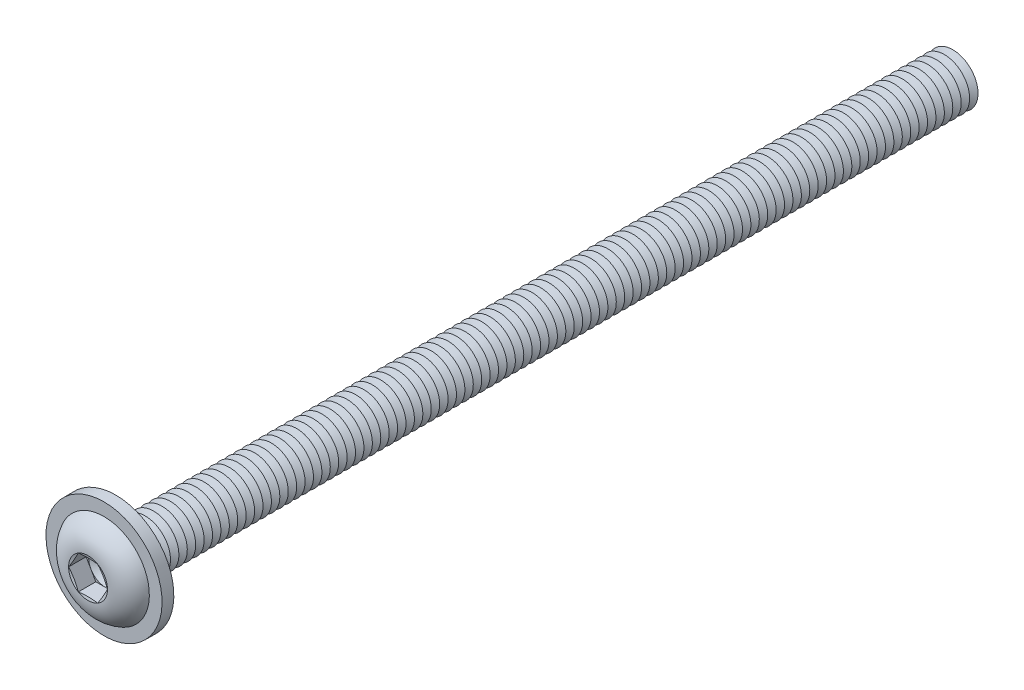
from build123d import *

# Parameters (mm, degrees)
FILLET1_R           = 0.25
LPATTERN1_COUNT     = 100
LPATTERN1_PITCH     = 0.5
CUT_EXTRUDE1_DEPTH  = 1.04
SKETCH5_R           = 3.45
SKETCH5_R_2         = 1.75
BOSS_EXTRUDE1_DEPTH = 0.7


with BuildPart() as part:
    # Sketch1 → Revolve1 (revolve)
    with BuildSketch(Plane(origin=(0, 0, 0), x_dir=(0, 0, -1), z_dir=(1, 0, 0))):
        with BuildLine():
            Line((0, 1.5), (0, 2.85))
            ThreePointArc((0, 2.85), (-1.182850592, 2.35063849), (-1.65, 1.1547))
            Line((-1.65, 1.1547), (-1.495299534, 0.57735))
            Line((-1.495299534, 0.57735), (-1.65, 0.57735))
            Line((-1.65, 0.57735), (-1.65, 0))
            Line((-1.65, 0), (50, 0))
            Line((50, 0), (50, 1.5))
            Line((50, 1.5), (0, 1.5))
        make_face()
    revolve(axis=Axis((0, 0, -50), (0, 0, 1)))

    # Fillet1
    fillet1_edges = [part.edges().sort_by_distance(p)[0] for p in [
        (0, -1.5, 0),
    ]]
    fillet(fillet1_edges, radius=FILLET1_R)

    # Sketch2 → Cut-Revolve1 (revolve, cut)
    with BuildSketch(Plane(origin=(0, 0, 0), x_dir=(0, 0, -1), z_dir=(1, 0, 0))):
        Polygon((49.75, 1.5), (50.25, 1.5), (50, 1.066987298), align=None)
    cut_revolve1 = revolve(axis=Axis((0, 0, -50), (0, 0, -1)), mode=Mode.SUBTRACT)

    # LPattern1: Cut-Revolve1 ×100
    with Locations(*[(0, 0, i * LPATTERN1_PITCH) for i in range(1, LPATTERN1_COUNT)]):
        add(cut_revolve1, mode=Mode.SUBTRACT)

    # Sketch3 → Cut-Extrude1 (cut)
    with BuildSketch(Plane.XY.offset(1.65)):
        Polygon((0.57735, 0.999999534), (-0.57735, 0.999999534), (-1.1547, 0), (-0.57735, -0.999999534), (0.57735, -0.999999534), (1.1547, 0), align=None)
    extrude(amount=-CUT_EXTRUDE1_DEPTH, mode=Mode.SUBTRACT)

    # Cut-Extrude2 cone 1 section (on through the dimple's axis) → Cut-Extrude2 (revolve, cut)
    with BuildSketch(Plane(origin=(0, 0, 0.61), x_dir=(0, -1, 0), z_dir=(1, 0, 0))):
        Polygon((0, 0), (0.999999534, 0), (0, 0.57735), align=None)
    revolve(axis=Axis((0, 0, 0.61), (0, 0, -1)), mode=Mode.SUBTRACT)

    # Sketch5 → Boss-Extrude1 (add)
    with BuildSketch(Plane(origin=(0, 0, 0), x_dir=(-1, 0, 0), z_dir=(0, 0, -1))):
        with Locations(Location((0, 0, 0), (0, 0, 90))):
            Circle(SKETCH5_R)
        Circle(SKETCH5_R_2, mode=Mode.SUBTRACT)
    extrude(amount=-BOSS_EXTRUDE1_DEPTH)


solid = part.part
